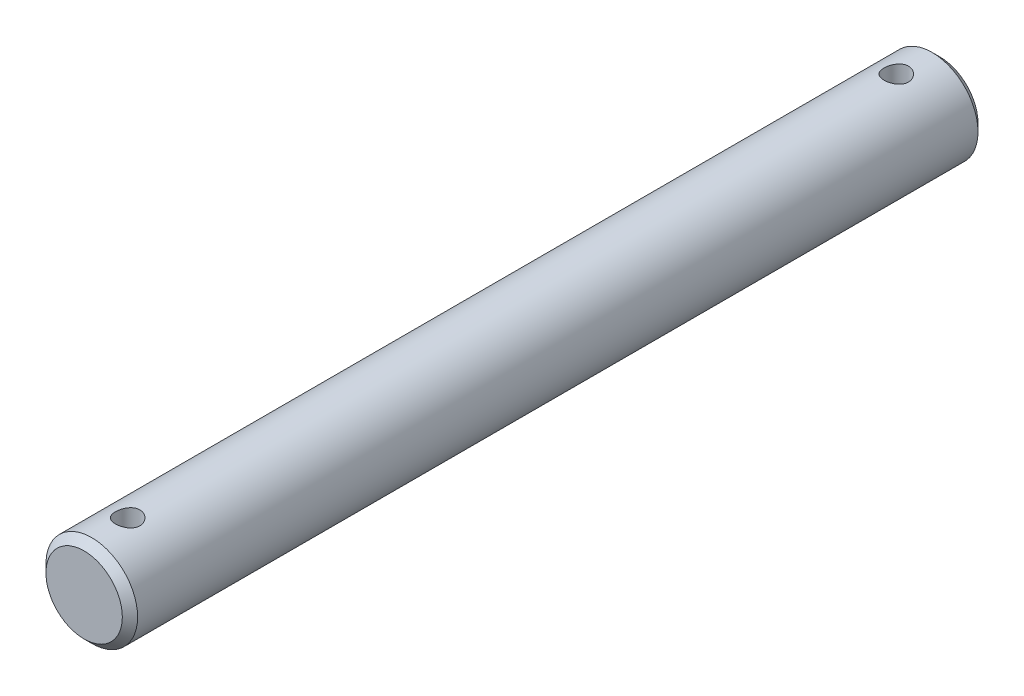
from build123d import *

# Parameters (mm, degrees)
ESQUISSE1_R           = 3
EXTRUSION1_DEPTH      = 28
CHANFREIN1_SIZE       = 0.5
EXTRUSION2_DEPTH      = 29.319604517
EXTRUSION2_DEPTH_BACK = 29.319604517
ESQUISSE2_R           = 0.8


with BuildPart() as part:
    # Esquisse1 → Extrusion1 (new, symmetric)
    with BuildSketch(Plane.XY):
        Circle(ESQUISSE1_R)
    extrude(amount=EXTRUSION1_DEPTH, both=True)

    # Chanfrein1
    chanfrein1_edges = [part.edges().sort_by_distance(p)[0] for p in [
        (-3, 0, -28),
        (-3, 0, 28),
    ]]
    chamfer(chanfrein1_edges, length=CHANFREIN1_SIZE)

    # Esquisse2 → Extrusion2 (cut, two sides: drawn at the far end of the back side and taken through both)
    with BuildSketch(Plane(origin=(0, 0, 0), x_dir=(1, 0, 0), z_dir=(0, 1, 0)).offset(-EXTRUSION2_DEPTH_BACK)):
        with Locations(Location((0, 25.15, 0), (0, 0, 270))):
            Circle(ESQUISSE2_R)
        with Locations(Location((0, -25.15, 0), (0, 0, 270))):
            Circle(ESQUISSE2_R)
    extrude(amount=EXTRUSION2_DEPTH + EXTRUSION2_DEPTH_BACK, mode=Mode.SUBTRACT)


solid = part.part
